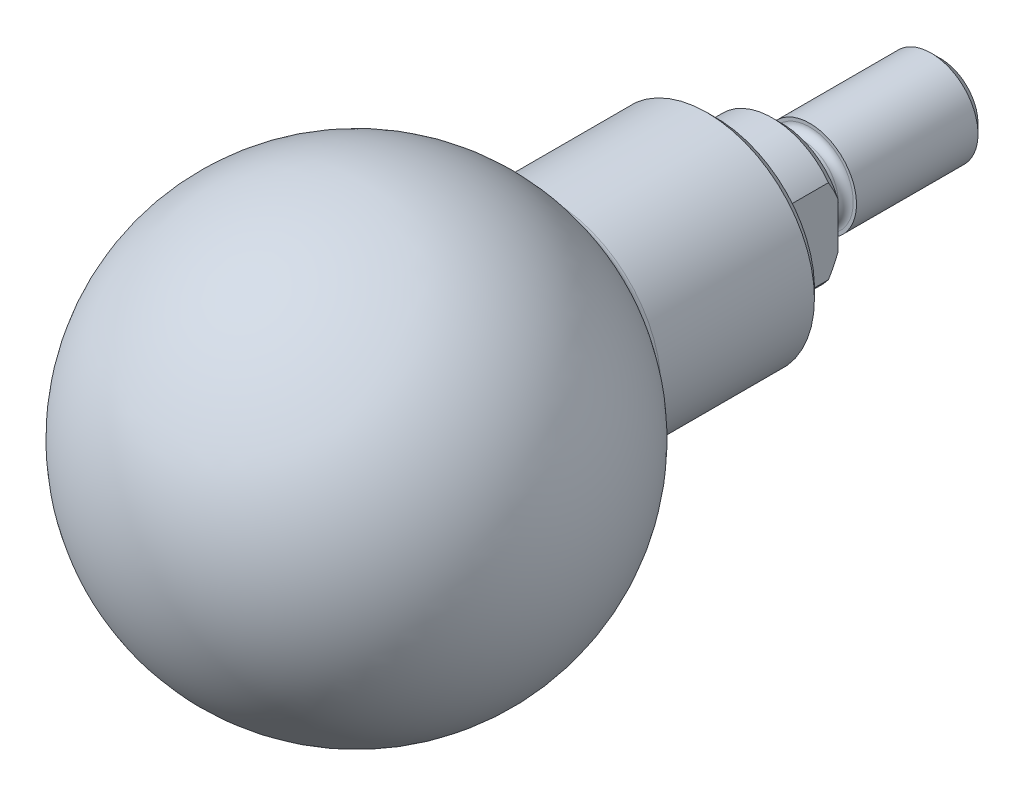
ISO-10303-21;
HEADER;
FILE_DESCRIPTION(('STEP AP214'),'2;1');
FILE_NAME('part.step','',(''),(''),'','','');
FILE_SCHEMA(('AUTOMOTIVE_DESIGN { 1 0 10303 214 1 1 1 1 }'));
ENDSEC;
DATA;
#1=APPLICATION_CONTEXT('core data for automotive mechanical design processes');
#2=APPLICATION_PROTOCOL_DEFINITION('international standard','automotive_design',2000,#1);
#3=PRODUCT_CONTEXT('',#1,'mechanical');
#4=PRODUCT('Part','Part','',(#3));
#5=PRODUCT_RELATED_PRODUCT_CATEGORY('part','',(#4));
#6=PRODUCT_DEFINITION_FORMATION('','',#4);
#7=PRODUCT_DEFINITION_CONTEXT('part definition',#1,'design');
#8=PRODUCT_DEFINITION('design','',#6,#7);
#9=PRODUCT_DEFINITION_SHAPE('','',#8);
#10=(LENGTH_UNIT() NAMED_UNIT(*) SI_UNIT(.MILLI.,.METRE.));
#11=(NAMED_UNIT(*) PLANE_ANGLE_UNIT() SI_UNIT($,.RADIAN.));
#12=(NAMED_UNIT(*) SI_UNIT($,.STERADIAN.) SOLID_ANGLE_UNIT());
#13=UNCERTAINTY_MEASURE_WITH_UNIT(LENGTH_MEASURE(1.E-05),#10,'distance_accuracy_value','');
#14=(GEOMETRIC_REPRESENTATION_CONTEXT(3) GLOBAL_UNCERTAINTY_ASSIGNED_CONTEXT((#13)) GLOBAL_UNIT_ASSIGNED_CONTEXT((#10,
#11,#12)) REPRESENTATION_CONTEXT('',''));
#15=CARTESIAN_POINT('',(0.,0.,0.));
#16=DIRECTION('',(0.,0.,1.));
#17=DIRECTION('',(1.,0.,0.));
#18=AXIS2_PLACEMENT_3D('',#15,#16,#17);
#19=CARTESIAN_POINT('',(-5.,0.,0.));
#20=DIRECTION('',(0.,0.,-1.));
#21=DIRECTION('',(0.,-1.,0.));
#22=AXIS2_PLACEMENT_3D('',#19,#20,#21);
#23=PLANE('',#22);
#24=CARTESIAN_POINT('',(0.,0.,0.));
#25=DIRECTION('',(0.,0.,-1.));
#26=DIRECTION('',(0.,-1.,0.));
#27=AXIS2_PLACEMENT_3D('',#24,#25,#26);
#28=CIRCLE('',#27,6.5);
#29=CARTESIAN_POINT('',(-6.,2.5,0.));
#30=VERTEX_POINT('',#29);
#31=CARTESIAN_POINT('',(6.,2.5,0.));
#32=VERTEX_POINT('',#31);
#33=EDGE_CURVE('E168',#30,#32,#28,.T.);
#34=ORIENTED_EDGE('',*,*,#33,.T.);
#35=DIRECTION('',(0.,-1.,0.));
#36=VECTOR('',#35,1.);
#37=CARTESIAN_POINT('',(6.,0.,0.));
#38=LINE('',#37,#36);
#39=CARTESIAN_POINT('',(6.,-2.5,0.));
#40=VERTEX_POINT('',#39);
#41=EDGE_CURVE('E30',#32,#40,#38,.T.);
#42=ORIENTED_EDGE('',*,*,#41,.T.);
#43=CARTESIAN_POINT('',(-6.,-2.5,0.));
#44=VERTEX_POINT('',#43);
#45=EDGE_CURVE('E192',#40,#44,#28,.T.);
#46=ORIENTED_EDGE('',*,*,#45,.T.);
#47=DIRECTION('',(0.,-1.,0.));
#48=VECTOR('',#47,1.);
#49=CARTESIAN_POINT('',(-6.,0.,0.));
#50=LINE('',#49,#48);
#51=EDGE_CURVE('E187',#30,#44,#50,.T.);
#52=ORIENTED_EDGE('',*,*,#51,.F.);
#53=EDGE_LOOP('',(#34,#42,#46,#52));
#54=FACE_BOUND('',#53,.T.);
#55=CARTESIAN_POINT('',(0.,0.,0.));
#56=DIRECTION('',(0.,0.,1.));
#57=DIRECTION('',(1.,0.,0.));
#58=AXIS2_PLACEMENT_3D('',#55,#56,#57);
#59=CIRCLE('',#58,4.65);
#60=CARTESIAN_POINT('',(4.65,0.,0.));
#61=VERTEX_POINT('',#60);
#62=EDGE_CURVE('E171',#61,#61,#59,.T.);
#63=ORIENTED_EDGE('',*,*,#62,.T.);
#64=EDGE_LOOP('',(#63));
#65=FACE_BOUND('',#64,.T.);
#66=ADVANCED_FACE('F14',(#54,#65),#23,.T.);
#67=CARTESIAN_POINT('',(0.,0.,-22.));
#68=DIRECTION('',(0.,0.,-1.));
#69=DIRECTION('',(0.,-1.,0.));
#70=AXIS2_PLACEMENT_3D('',#67,#68,#69);
#71=CYLINDRICAL_SURFACE('',#70,7.5);
#72=DIRECTION('',(0.,0.,-1.));
#73=VECTOR('',#72,1.);
#74=CARTESIAN_POINT('',(6.,-4.5,-22.));
#75=LINE('',#74,#73);
#76=CARTESIAN_POINT('',(6.,-4.5,7.));
#77=VERTEX_POINT('',#76);
#78=CARTESIAN_POINT('',(6.,-4.5,1.));
#79=VERTEX_POINT('',#78);
#80=EDGE_CURVE('E182',#77,#79,#75,.T.);
#81=ORIENTED_EDGE('',*,*,#80,.F.);
#82=CARTESIAN_POINT('',(0.,0.,7.));
#83=DIRECTION('',(0.,0.,-1.));
#84=DIRECTION('',(0.,-1.,0.));
#85=AXIS2_PLACEMENT_3D('',#82,#83,#84);
#86=CIRCLE('',#85,7.5);
#87=CARTESIAN_POINT('',(-6.,-4.5,7.));
#88=VERTEX_POINT('',#87);
#89=EDGE_CURVE('E84',#77,#88,#86,.T.);
#90=ORIENTED_EDGE('',*,*,#89,.T.);
#91=DIRECTION('',(0.,0.,-1.));
#92=VECTOR('',#91,1.);
#93=CARTESIAN_POINT('',(-6.,-4.5,-22.));
#94=LINE('',#93,#92);
#95=CARTESIAN_POINT('',(-6.,-4.5,1.));
#96=VERTEX_POINT('',#95);
#97=EDGE_CURVE('E190',#88,#96,#94,.T.);
#98=ORIENTED_EDGE('',*,*,#97,.T.);
#99=CARTESIAN_POINT('',(0.,0.,1.));
#100=DIRECTION('',(0.,0.,-1.));
#101=DIRECTION('',(0.,-1.,0.));
#102=AXIS2_PLACEMENT_3D('',#99,#100,#101);
#103=CIRCLE('',#102,7.5);
#104=EDGE_CURVE('E193',#79,#96,#103,.T.);
#105=ORIENTED_EDGE('',*,*,#104,.F.);
#106=EDGE_LOOP('',(#81,#90,#98,#105));
#107=FACE_BOUND('',#106,.T.);
#108=ADVANCED_FACE('F127',(#107),#71,.T.);
#109=DIRECTION('',(0.,0.,-1.));
#110=VECTOR('',#109,1.);
#111=CARTESIAN_POINT('',(6.,4.5,-22.));
#112=LINE('',#111,#110);
#113=CARTESIAN_POINT('',(6.,4.5,1.));
#114=VERTEX_POINT('',#113);
#115=CARTESIAN_POINT('',(6.,4.5,7.));
#116=VERTEX_POINT('',#115);
#117=EDGE_CURVE('E66',#114,#116,#112,.F.);
#118=ORIENTED_EDGE('',*,*,#117,.F.);
#119=CARTESIAN_POINT('',(-6.,4.5,1.));
#120=VERTEX_POINT('',#119);
#121=EDGE_CURVE('E92',#120,#114,#103,.T.);
#122=ORIENTED_EDGE('',*,*,#121,.F.);
#123=DIRECTION('',(0.,0.,-1.));
#124=VECTOR('',#123,1.);
#125=CARTESIAN_POINT('',(-6.,4.5,-22.));
#126=LINE('',#125,#124);
#127=CARTESIAN_POINT('',(-6.,4.5,7.));
#128=VERTEX_POINT('',#127);
#129=EDGE_CURVE('E38',#120,#128,#126,.F.);
#130=ORIENTED_EDGE('',*,*,#129,.T.);
#131=EDGE_CURVE('E83',#128,#116,#86,.T.);
#132=ORIENTED_EDGE('',*,*,#131,.T.);
#133=EDGE_LOOP('',(#118,#122,#130,#132));
#134=FACE_BOUND('',#133,.T.);
#135=ADVANCED_FACE('F86',(#134),#71,.T.);
#136=CARTESIAN_POINT('',(0.,0.,1.));
#137=DIRECTION('',(0.,0.,1.));
#138=DIRECTION('',(0.,1.,0.));
#139=AXIS2_PLACEMENT_3D('',#136,#137,#138);
#140=CONICAL_SURFACE('',#139,7.5,0.785398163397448);
#141=CARTESIAN_POINT('',(6.,10.3130926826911,5.43146599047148));
#142=CARTESIAN_POINT('',(6.,10.0655205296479,5.21751654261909));
#143=CARTESIAN_POINT('',(6.,9.81701833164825,5.00463051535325));
#144=CARTESIAN_POINT('',(6.,9.31765871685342,4.58155698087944));
#145=CARTESIAN_POINT('',(6.,9.06680091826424,4.37136992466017));
#146=CARTESIAN_POINT('',(6.,8.56053930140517,3.95286799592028));
#147=CARTESIAN_POINT('',(6.,8.30511590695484,3.74457674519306));
#148=CARTESIAN_POINT('',(6.,7.79085536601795,3.33228285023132));
#149=CARTESIAN_POINT('',(6.,7.53201847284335,3.12827989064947));
#150=CARTESIAN_POINT('',(6.,6.98862232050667,2.709151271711));
#151=CARTESIAN_POINT('',(6.,6.70370040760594,2.49449347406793));
#152=CARTESIAN_POINT('',(6.,6.1275241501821,2.07366874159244));
#153=CARTESIAN_POINT('',(6.,5.83626830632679,1.86750385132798));
#154=CARTESIAN_POINT('',(6.,5.24662347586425,1.46744306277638));
#155=CARTESIAN_POINT('',(6.,4.94825856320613,1.27351214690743));
#156=CARTESIAN_POINT('',(6.,4.49322817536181,0.994986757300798));
#157=CARTESIAN_POINT('',(6.,4.34033653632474,0.904224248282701));
#158=CARTESIAN_POINT('',(6.,4.03173263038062,0.727643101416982));
#159=CARTESIAN_POINT('',(6.,3.87602072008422,0.641823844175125));
#160=CARTESIAN_POINT('',(6.,3.61310554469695,0.503319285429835));
#161=CARTESIAN_POINT('',(6.,3.50676029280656,0.449006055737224));
#162=CARTESIAN_POINT('',(6.,3.29257477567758,0.343417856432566));
#163=CARTESIAN_POINT('',(6.,3.1847345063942,0.292142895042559));
#164=CARTESIAN_POINT('',(6.,2.85878731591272,0.143435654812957));
#165=CARTESIAN_POINT('',(6.,2.63828519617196,0.0511377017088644));
#166=CARTESIAN_POINT('',(6.,2.19371379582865,-0.114824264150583));
#167=CARTESIAN_POINT('',(6.,1.96973381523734,-0.188724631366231));
#168=CARTESIAN_POINT('',(6.,1.51582747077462,-0.31531052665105));
#169=CARTESIAN_POINT('',(6.,1.28590425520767,-0.368007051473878));
#170=CARTESIAN_POINT('',(6.,0.876430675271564,-0.438846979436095));
#171=CARTESIAN_POINT('',(6.,0.697782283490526,-0.462207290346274));
#172=CARTESIAN_POINT('',(6.,0.339125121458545,-0.493076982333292));
#173=CARTESIAN_POINT('',(6.,0.159116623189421,-0.500589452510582));
#174=CARTESIAN_POINT('',(6.,-0.200861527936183,-0.499337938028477));
#175=CARTESIAN_POINT('',(6.,-0.380831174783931,-0.490572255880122));
#176=CARTESIAN_POINT('',(6.,-0.739309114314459,-0.457261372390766));
#177=CARTESIAN_POINT('',(6.,-0.917817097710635,-0.432712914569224));
#178=CARTESIAN_POINT('',(6.,-1.32540328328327,-0.359530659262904));
#179=CARTESIAN_POINT('',(6.,-1.55358031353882,-0.305879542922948));
#180=CARTESIAN_POINT('',(6.,-2.00401392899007,-0.177871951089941));
#181=CARTESIAN_POINT('',(6.,-2.2262676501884,-0.103505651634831));
#182=CARTESIAN_POINT('',(6.,-2.66755500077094,0.0630384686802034));
#183=CARTESIAN_POINT('',(6.,-2.88649724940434,0.15545559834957));
#184=CARTESIAN_POINT('',(6.,-3.21017428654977,0.304120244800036));
#185=CARTESIAN_POINT('',(6.,-3.31726762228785,0.355343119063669));
#186=CARTESIAN_POINT('',(6.,-3.52997860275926,0.460762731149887));
#187=CARTESIAN_POINT('',(6.,-3.63559629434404,0.514959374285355));
#188=CARTESIAN_POINT('',(6.,-3.94622481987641,0.679287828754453));
#189=CARTESIAN_POINT('',(6.,-4.14926653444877,0.793146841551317));
#190=CARTESIAN_POINT('',(6.,-4.55072026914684,1.02878860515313));
#191=CARTESIAN_POINT('',(6.,-4.74913115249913,1.15057327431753));
#192=CARTESIAN_POINT('',(6.,-5.14212327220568,1.40053324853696));
#193=CARTESIAN_POINT('',(6.,-5.33670087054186,1.52871425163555));
#194=CARTESIAN_POINT('',(6.,-5.72241014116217,1.79010728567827));
#195=CARTESIAN_POINT('',(6.,-5.91354208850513,1.92331891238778));
#196=CARTESIAN_POINT('',(6.,-6.29374822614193,2.19444777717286));
#197=CARTESIAN_POINT('',(6.,-6.48280904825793,2.33238371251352));
#198=CARTESIAN_POINT('',(6.,-6.85841344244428,2.61164642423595));
#199=CARTESIAN_POINT('',(6.,-7.04495692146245,2.75297332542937));
#200=CARTESIAN_POINT('',(6.,-7.60117657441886,3.18099010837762));
#201=CARTESIAN_POINT('',(6.,-7.96763796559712,3.47185772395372));
#202=CARTESIAN_POINT('',(6.,-8.6568955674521,4.03118084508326));
#203=CARTESIAN_POINT('',(6.,-8.98031469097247,4.29887455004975));
#204=CARTESIAN_POINT('',(6.,-9.62316368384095,4.83908849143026));
#205=CARTESIAN_POINT('',(6.,-9.94259303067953,5.11160934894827));
#206=CARTESIAN_POINT('',(6.,-10.5751403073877,5.65764347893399));
#207=CARTESIAN_POINT('',(6.,-10.8882894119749,5.93112073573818));
#208=CARTESIAN_POINT('',(6.,-11.5119693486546,6.48091563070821));
#209=CARTESIAN_POINT('',(6.,-11.8225007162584,6.75723266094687));
#210=CARTESIAN_POINT('',(6.,-12.1320438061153,7.03464025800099));
#211=B_SPLINE_CURVE_WITH_KNOTS('',3,(#141,#142,#143,#144,#145,#146,#147,#148,#149,#150,#151,
#152,#153,#154,#155,#156,#157,#158,#159,#160,#161,#162,#163,#164,#165,#166,#167,#168,#169,#170,
#171,#172,#173,#174,#175,#176,#177,#178,#179,#180,#181,#182,#183,#184,#185,#186,#187,#188,#189,
#190,#191,#192,#193,#194,#195,#196,#197,#198,#199,#200,#201,#202,#203,#204,#205,#206,#207,#208,
#209,#210),.UNSPECIFIED.,.F.,.F.,(4,2,2,2,2,2,2,2,2,2,2,2,2,2,2,2,2,2,2,2,2,2,2,2,2,2,2,2,2,2,2,
2,2,2,4),(0.,0.981639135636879,1.9634402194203,2.95215814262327,3.94080310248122,
5.01087904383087,6.08121110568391,7.14832575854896,7.68166298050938,8.21493322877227,
8.57312457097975,8.93131688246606,9.64780743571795,10.3545535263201,11.0609326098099,
11.6007988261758,12.1405598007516,12.6803770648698,13.2203057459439,13.9222752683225,
14.6245782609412,15.3369157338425,15.6930190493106,16.0491110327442,16.7472209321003,
17.4455004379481,18.1444135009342,18.8432705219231,19.5453162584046,20.2473878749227,
21.6508059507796,22.910256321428,24.1698699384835,25.4171160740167,26.6641005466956),.UNSPECIFIED.);
#212=EDGE_CURVE('E200',#79,#40,#211,.F.);
#213=ORIENTED_EDGE('',*,*,#212,.F.);
#214=ORIENTED_EDGE('',*,*,#104,.T.);
#215=CARTESIAN_POINT('',(-6.,10.3130926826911,5.43146599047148));
#216=CARTESIAN_POINT('',(-6.,10.0655205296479,5.21751654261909));
#217=CARTESIAN_POINT('',(-6.,9.81701833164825,5.00463051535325));
#218=CARTESIAN_POINT('',(-6.,9.31765871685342,4.58155698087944));
#219=CARTESIAN_POINT('',(-6.,9.06680091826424,4.37136992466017));
#220=CARTESIAN_POINT('',(-6.,8.56053930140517,3.95286799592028));
#221=CARTESIAN_POINT('',(-6.,8.30511590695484,3.74457674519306));
#222=CARTESIAN_POINT('',(-6.,7.79085536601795,3.33228285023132));
#223=CARTESIAN_POINT('',(-6.,7.53201847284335,3.12827989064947));
#224=CARTESIAN_POINT('',(-6.,6.98862232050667,2.709151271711));
#225=CARTESIAN_POINT('',(-6.,6.70370040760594,2.49449347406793));
#226=CARTESIAN_POINT('',(-6.,6.1275241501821,2.07366874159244));
#227=CARTESIAN_POINT('',(-6.,5.83626830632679,1.86750385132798));
#228=CARTESIAN_POINT('',(-6.,5.24662347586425,1.46744306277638));
#229=CARTESIAN_POINT('',(-6.,4.94825856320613,1.27351214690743));
#230=CARTESIAN_POINT('',(-6.,4.49322817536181,0.994986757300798));
#231=CARTESIAN_POINT('',(-6.,4.34033653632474,0.904224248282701));
#232=CARTESIAN_POINT('',(-6.,4.03173263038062,0.727643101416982));
#233=CARTESIAN_POINT('',(-6.,3.87602072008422,0.641823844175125));
#234=CARTESIAN_POINT('',(-6.,3.61310554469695,0.503319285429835));
#235=CARTESIAN_POINT('',(-6.,3.50676029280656,0.449006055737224));
#236=CARTESIAN_POINT('',(-6.,3.29257477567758,0.343417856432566));
#237=CARTESIAN_POINT('',(-6.,3.1847345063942,0.292142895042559));
#238=CARTESIAN_POINT('',(-6.,2.85878731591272,0.143435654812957));
#239=CARTESIAN_POINT('',(-6.,2.63828519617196,0.0511377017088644));
#240=CARTESIAN_POINT('',(-6.,2.19371379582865,-0.114824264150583));
#241=CARTESIAN_POINT('',(-6.,1.96973381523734,-0.188724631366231));
#242=CARTESIAN_POINT('',(-6.,1.51582747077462,-0.31531052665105));
#243=CARTESIAN_POINT('',(-6.,1.28590425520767,-0.368007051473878));
#244=CARTESIAN_POINT('',(-6.,0.876430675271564,-0.438846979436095));
#245=CARTESIAN_POINT('',(-6.,0.697782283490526,-0.462207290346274));
#246=CARTESIAN_POINT('',(-6.,0.339125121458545,-0.493076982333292));
#247=CARTESIAN_POINT('',(-6.,0.159116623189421,-0.500589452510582));
#248=CARTESIAN_POINT('',(-6.,-0.200861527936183,-0.499337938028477));
#249=CARTESIAN_POINT('',(-6.,-0.380831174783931,-0.490572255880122));
#250=CARTESIAN_POINT('',(-6.,-0.739309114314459,-0.457261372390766));
#251=CARTESIAN_POINT('',(-6.,-0.917817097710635,-0.432712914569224));
#252=CARTESIAN_POINT('',(-6.,-1.32540328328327,-0.359530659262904));
#253=CARTESIAN_POINT('',(-6.,-1.55358031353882,-0.305879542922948));
#254=CARTESIAN_POINT('',(-6.,-2.00401392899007,-0.177871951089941));
#255=CARTESIAN_POINT('',(-6.,-2.2262676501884,-0.103505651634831));
#256=CARTESIAN_POINT('',(-6.,-2.66755500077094,0.0630384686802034));
#257=CARTESIAN_POINT('',(-6.,-2.88649724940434,0.15545559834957));
#258=CARTESIAN_POINT('',(-6.,-3.21017428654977,0.304120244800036));
#259=CARTESIAN_POINT('',(-6.,-3.31726762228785,0.355343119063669));
#260=CARTESIAN_POINT('',(-6.,-3.52997860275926,0.460762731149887));
#261=CARTESIAN_POINT('',(-6.,-3.63559629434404,0.514959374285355));
#262=CARTESIAN_POINT('',(-6.,-3.94622481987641,0.679287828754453));
#263=CARTESIAN_POINT('',(-6.,-4.14926653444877,0.793146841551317));
#264=CARTESIAN_POINT('',(-6.,-4.55072026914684,1.02878860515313));
#265=CARTESIAN_POINT('',(-6.,-4.74913115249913,1.15057327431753));
#266=CARTESIAN_POINT('',(-6.,-5.14212327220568,1.40053324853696));
#267=CARTESIAN_POINT('',(-6.,-5.33670087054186,1.52871425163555));
#268=CARTESIAN_POINT('',(-6.,-5.72241014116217,1.79010728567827));
#269=CARTESIAN_POINT('',(-6.,-5.91354208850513,1.92331891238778));
#270=CARTESIAN_POINT('',(-6.,-6.29374822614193,2.19444777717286));
#271=CARTESIAN_POINT('',(-6.,-6.48280904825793,2.33238371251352));
#272=CARTESIAN_POINT('',(-6.,-6.85841344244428,2.61164642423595));
#273=CARTESIAN_POINT('',(-6.,-7.04495692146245,2.75297332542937));
#274=CARTESIAN_POINT('',(-6.,-7.60117657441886,3.18099010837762));
#275=CARTESIAN_POINT('',(-6.,-7.96763796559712,3.47185772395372));
#276=CARTESIAN_POINT('',(-6.,-8.6568955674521,4.03118084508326));
#277=CARTESIAN_POINT('',(-6.,-8.98031469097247,4.29887455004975));
#278=CARTESIAN_POINT('',(-6.,-9.62316368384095,4.83908849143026));
#279=CARTESIAN_POINT('',(-6.,-9.94259303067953,5.11160934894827));
#280=CARTESIAN_POINT('',(-6.,-10.5751403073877,5.65764347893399));
#281=CARTESIAN_POINT('',(-6.,-10.8882894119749,5.93112073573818));
#282=CARTESIAN_POINT('',(-6.,-11.5119693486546,6.48091563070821));
#283=CARTESIAN_POINT('',(-6.,-11.8225007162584,6.75723266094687));
#284=CARTESIAN_POINT('',(-6.,-12.1320438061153,7.03464025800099));
#285=B_SPLINE_CURVE_WITH_KNOTS('',3,(#215,#216,#217,#218,#219,#220,#221,#222,#223,#224,#225,
#226,#227,#228,#229,#230,#231,#232,#233,#234,#235,#236,#237,#238,#239,#240,#241,#242,#243,#244,
#245,#246,#247,#248,#249,#250,#251,#252,#253,#254,#255,#256,#257,#258,#259,#260,#261,#262,#263,
#264,#265,#266,#267,#268,#269,#270,#271,#272,#273,#274,#275,#276,#277,#278,#279,#280,#281,#282,
#283,#284),.UNSPECIFIED.,.F.,.F.,(4,2,2,2,2,2,2,2,2,2,2,2,2,2,2,2,2,2,2,2,2,2,2,2,2,2,2,2,2,2,2,
2,2,2,4),(0.,0.981639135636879,1.9634402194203,2.95215814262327,3.94080310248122,
5.01087904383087,6.08121110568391,7.14832575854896,7.68166298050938,8.21493322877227,
8.57312457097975,8.93131688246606,9.64780743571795,10.3545535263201,11.0609326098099,
11.6007988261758,12.1405598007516,12.6803770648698,13.2203057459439,13.9222752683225,
14.6245782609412,15.3369157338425,15.6930190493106,16.0491110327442,16.7472209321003,
17.4455004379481,18.1444135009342,18.8432705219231,19.5453162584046,20.2473878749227,
21.6508059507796,22.910256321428,24.1698699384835,25.4171160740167,26.6641005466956),.UNSPECIFIED.);
#286=EDGE_CURVE('E112',#96,#44,#285,.F.);
#287=ORIENTED_EDGE('',*,*,#286,.T.);
#288=ORIENTED_EDGE('',*,*,#45,.F.);
#289=EDGE_LOOP('',(#213,#214,#287,#288));
#290=FACE_BOUND('',#289,.T.);
#291=ADVANCED_FACE('F121',(#290),#140,.T.);
#292=EDGE_CURVE('E71',#32,#114,#211,.F.);
#293=ORIENTED_EDGE('',*,*,#292,.F.);
#294=ORIENTED_EDGE('',*,*,#33,.F.);
#295=EDGE_CURVE('E104',#30,#120,#285,.F.);
#296=ORIENTED_EDGE('',*,*,#295,.T.);
#297=ORIENTED_EDGE('',*,*,#121,.T.);
#298=EDGE_LOOP('',(#293,#294,#296,#297));
#299=FACE_BOUND('',#298,.T.);
#300=ADVANCED_FACE('F125',(#299),#140,.T.);
#301=CARTESIAN_POINT('',(0.,0.,45.5));
#302=DIRECTION('',(0.,-1.,0.));
#303=DIRECTION('',(0.,0.,1.));
#304=AXIS2_PLACEMENT_3D('',#301,#302,#303);
#305=SPHERICAL_SURFACE('',#304,23.5);
#306=CARTESIAN_POINT('',(0.,0.,45.5));
#307=DIRECTION('',(0.,0.,-1.));
#308=DIRECTION('',(0.,-1.,0.));
#309=AXIS2_PLACEMENT_3D('',#306,#307,#308);
#310=SPHERICAL_SURFACE('',#309,23.5);
#311=CARTESIAN_POINT('',(0.,0.,25.2887458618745));
#312=DIRECTION('',(0.,0.,-1.));
#313=DIRECTION('',(0.,-1.,0.));
#314=AXIS2_PLACEMENT_3D('',#311,#312,#313);
#315=CIRCLE('',#314,11.9897959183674);
#316=CARTESIAN_POINT('',(0.,-11.9897959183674,25.2887458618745));
#317=VERTEX_POINT('',#316);
#318=EDGE_CURVE('E101',#317,#317,#315,.T.);
#319=ORIENTED_EDGE('',*,*,#318,.F.);
#320=EDGE_LOOP('',(#319));
#321=FACE_BOUND('',#320,.T.);
#322=ADVANCED_FACE('F145',(#321),#310,.T.);
#323=CARTESIAN_POINT('',(0.,0.,24.4286924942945));
#324=DIRECTION('',(0.,0.,-1.));
#325=DIRECTION('',(0.,-1.,0.));
#326=AXIS2_PLACEMENT_3D('',#323,#324,#325);
#327=TOROIDAL_SURFACE('',#326,12.5,1.);
#328=ORIENTED_EDGE('',*,*,#318,.T.);
#329=EDGE_LOOP('',(#328));
#330=FACE_BOUND('',#329,.T.);
#331=CARTESIAN_POINT('',(0.,0.,24.4286924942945));
#332=DIRECTION('',(0.,0.,-1.));
#333=DIRECTION('',(0.,-1.,0.));
#334=AXIS2_PLACEMENT_3D('',#331,#332,#333);
#335=CIRCLE('',#334,11.5);
#336=CARTESIAN_POINT('',(0.,-11.5,24.4286924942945));
#337=VERTEX_POINT('',#336);
#338=EDGE_CURVE('E98',#337,#337,#335,.T.);
#339=ORIENTED_EDGE('',*,*,#338,.F.);
#340=EDGE_LOOP('',(#339));
#341=FACE_BOUND('',#340,.T.);
#342=ADVANCED_FACE('F141',(#330,#341),#327,.F.);
#343=CARTESIAN_POINT('',(0.,0.,-22.));
#344=DIRECTION('',(0.,0.,-1.));
#345=DIRECTION('',(0.,-1.,0.));
#346=AXIS2_PLACEMENT_3D('',#343,#344,#345);
#347=CYLINDRICAL_SURFACE('',#346,11.5);
#348=ORIENTED_EDGE('',*,*,#338,.T.);
#349=EDGE_LOOP('',(#348));
#350=FACE_BOUND('',#349,.T.);
#351=CARTESIAN_POINT('',(0.,0.,8.));
#352=DIRECTION('',(0.,0.,-1.));
#353=DIRECTION('',(0.,-1.,0.));
#354=AXIS2_PLACEMENT_3D('',#351,#352,#353);
#355=CIRCLE('',#354,11.5);
#356=CARTESIAN_POINT('',(0.,-11.5,8.));
#357=VERTEX_POINT('',#356);
#358=EDGE_CURVE('E90',#357,#357,#355,.T.);
#359=ORIENTED_EDGE('',*,*,#358,.F.);
#360=EDGE_LOOP('',(#359));
#361=FACE_BOUND('',#360,.T.);
#362=ADVANCED_FACE('F137',(#350,#361),#347,.T.);
#363=CARTESIAN_POINT('',(0.,0.,8.));
#364=DIRECTION('',(0.,0.,1.));
#365=DIRECTION('',(0.,1.,0.));
#366=AXIS2_PLACEMENT_3D('',#363,#364,#365);
#367=CONICAL_SURFACE('',#366,11.5,0.785398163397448);
#368=CARTESIAN_POINT('',(0.,0.,7.));
#369=DIRECTION('',(0.,0.,-1.));
#370=DIRECTION('',(0.,-1.,0.));
#371=AXIS2_PLACEMENT_3D('',#368,#369,#370);
#372=CIRCLE('',#371,10.5);
#373=CARTESIAN_POINT('',(0.,-10.5,7.));
#374=VERTEX_POINT('',#373);
#375=EDGE_CURVE('E87',#374,#374,#372,.T.);
#376=ORIENTED_EDGE('',*,*,#375,.F.);
#377=EDGE_LOOP('',(#376));
#378=FACE_BOUND('',#377,.T.);
#379=ORIENTED_EDGE('',*,*,#358,.T.);
#380=EDGE_LOOP('',(#379));
#381=FACE_BOUND('',#380,.T.);
#382=ADVANCED_FACE('F134',(#378,#381),#367,.T.);
#383=CARTESIAN_POINT('',(-10.5,0.,7.));
#384=DIRECTION('',(0.,0.,1.));
#385=DIRECTION('',(0.,1.,0.));
#386=AXIS2_PLACEMENT_3D('',#383,#384,#385);
#387=PLANE('',#386);
#388=ORIENTED_EDGE('',*,*,#89,.F.);
#389=DIRECTION('',(0.,-1.,0.));
#390=VECTOR('',#389,1.);
#391=CARTESIAN_POINT('',(6.,5.,7.));
#392=LINE('',#391,#390);
#393=EDGE_CURVE('E69',#116,#77,#392,.T.);
#394=ORIENTED_EDGE('',*,*,#393,.F.);
#395=ORIENTED_EDGE('',*,*,#131,.F.);
#396=DIRECTION('',(0.,-1.,0.));
#397=VECTOR('',#396,1.);
#398=CARTESIAN_POINT('',(-6.,5.,7.));
#399=LINE('',#398,#397);
#400=EDGE_CURVE('E184',#128,#88,#399,.T.);
#401=ORIENTED_EDGE('',*,*,#400,.T.);
#402=EDGE_LOOP('',(#388,#394,#395,#401));
#403=FACE_BOUND('',#402,.T.);
#404=ORIENTED_EDGE('',*,*,#375,.T.);
#405=EDGE_LOOP('',(#404));
#406=FACE_BOUND('',#405,.T.);
#407=ADVANCED_FACE('F80',(#403,#406),#387,.F.);
#408=CARTESIAN_POINT('',(-6.,5.,-0.886589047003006));
#409=DIRECTION('',(1.,0.,0.));
#410=DIRECTION('',(0.,1.,0.));
#411=AXIS2_PLACEMENT_3D('',#408,#409,#410);
#412=PLANE('',#411);
#413=ORIENTED_EDGE('',*,*,#400,.F.);
#414=ORIENTED_EDGE('',*,*,#129,.F.);
#415=ORIENTED_EDGE('',*,*,#295,.F.);
#416=ORIENTED_EDGE('',*,*,#51,.T.);
#417=ORIENTED_EDGE('',*,*,#286,.F.);
#418=ORIENTED_EDGE('',*,*,#97,.F.);
#419=EDGE_LOOP('',(#413,#414,#415,#416,#417,#418));
#420=FACE_BOUND('',#419,.T.);
#421=ADVANCED_FACE('F119',(#420),#412,.F.);
#422=CARTESIAN_POINT('',(6.,5.,-0.886589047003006));
#423=DIRECTION('',(1.,0.,0.));
#424=DIRECTION('',(0.,1.,0.));
#425=AXIS2_PLACEMENT_3D('',#422,#423,#424);
#426=PLANE('',#425);
#427=ORIENTED_EDGE('',*,*,#80,.T.);
#428=ORIENTED_EDGE('',*,*,#212,.T.);
#429=ORIENTED_EDGE('',*,*,#41,.F.);
#430=ORIENTED_EDGE('',*,*,#292,.T.);
#431=ORIENTED_EDGE('',*,*,#117,.T.);
#432=ORIENTED_EDGE('',*,*,#393,.T.);
#433=EDGE_LOOP('',(#427,#428,#429,#430,#431,#432));
#434=FACE_BOUND('',#433,.T.);
#435=ADVANCED_FACE('F68',(#434),#426,.T.);
#436=CARTESIAN_POINT('',(0.,4.65,-3.));
#437=DIRECTION('',(0.,0.,1.));
#438=DIRECTION('',(1.,0.,0.));
#439=AXIS2_PLACEMENT_3D('',#436,#437,#438);
#440=PLANE('',#439);
#441=CARTESIAN_POINT('',(0.,0.,-3.));
#442=DIRECTION('',(0.,0.,1.));
#443=DIRECTION('',(1.,0.,0.));
#444=AXIS2_PLACEMENT_3D('',#441,#442,#443);
#445=CIRCLE('',#444,4.65);
#446=CARTESIAN_POINT('',(4.65,0.,-3.));
#447=VERTEX_POINT('',#446);
#448=EDGE_CURVE('E239',#447,#447,#445,.T.);
#449=ORIENTED_EDGE('',*,*,#448,.F.);
#450=EDGE_LOOP('',(#449));
#451=FACE_BOUND('',#450,.T.);
#452=CARTESIAN_POINT('',(0.,0.,-3.));
#453=DIRECTION('',(0.,0.,1.));
#454=DIRECTION('',(1.,0.,0.));
#455=AXIS2_PLACEMENT_3D('',#452,#453,#454);
#456=CIRCLE('',#455,5.);
#457=CARTESIAN_POINT('',(5.,0.,-3.));
#458=VERTEX_POINT('',#457);
#459=EDGE_CURVE('E18',#458,#458,#456,.T.);
#460=ORIENTED_EDGE('',*,*,#459,.T.);
#461=EDGE_LOOP('',(#460));
#462=FACE_BOUND('',#461,.T.);
#463=ADVANCED_FACE('F213',(#451,#462),#440,.T.);
#464=CARTESIAN_POINT('',(0.,0.,-0.8));
#465=DIRECTION('',(0.,0.,1.));
#466=DIRECTION('',(1.,0.,0.));
#467=AXIS2_PLACEMENT_3D('',#464,#465,#466);
#468=TOROIDAL_SURFACE('',#467,4.65,0.8);
#469=CARTESIAN_POINT('',(0.,0.,-0.8));
#470=DIRECTION('',(0.,0.,1.));
#471=DIRECTION('',(1.,0.,0.));
#472=AXIS2_PLACEMENT_3D('',#469,#470,#471);
#473=CIRCLE('',#472,3.85);
#474=CARTESIAN_POINT('',(3.85,0.,-0.8));
#475=VERTEX_POINT('',#474);
#476=EDGE_CURVE('E173',#475,#475,#473,.T.);
#477=ORIENTED_EDGE('',*,*,#476,.T.);
#478=EDGE_LOOP('',(#477));
#479=FACE_BOUND('',#478,.T.);
#480=ORIENTED_EDGE('',*,*,#62,.F.);
#481=EDGE_LOOP('',(#480));
#482=FACE_BOUND('',#481,.T.);
#483=ADVANCED_FACE('F215',(#479,#482),#468,.F.);
#484=CARTESIAN_POINT('',(0.,0.,18.671110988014));
#485=DIRECTION('',(0.,0.,1.));
#486=DIRECTION('',(1.,0.,0.));
#487=AXIS2_PLACEMENT_3D('',#484,#485,#486);
#488=CYLINDRICAL_SURFACE('',#487,3.85);
#489=CARTESIAN_POINT('',(0.,0.,-2.2));
#490=DIRECTION('',(0.,0.,1.));
#491=DIRECTION('',(1.,0.,0.));
#492=AXIS2_PLACEMENT_3D('',#489,#490,#491);
#493=CIRCLE('',#492,3.85);
#494=CARTESIAN_POINT('',(3.85,0.,-2.2));
#495=VERTEX_POINT('',#494);
#496=EDGE_CURVE('E177',#495,#495,#493,.T.);
#497=ORIENTED_EDGE('',*,*,#496,.T.);
#498=EDGE_LOOP('',(#497));
#499=FACE_BOUND('',#498,.T.);
#500=ORIENTED_EDGE('',*,*,#476,.F.);
#501=EDGE_LOOP('',(#500));
#502=FACE_BOUND('',#501,.T.);
#503=ADVANCED_FACE('F223',(#499,#502),#488,.T.);
#504=CARTESIAN_POINT('',(0.,0.,-2.2));
#505=DIRECTION('',(0.,0.,1.));
#506=DIRECTION('',(1.,0.,0.));
#507=AXIS2_PLACEMENT_3D('',#504,#505,#506);
#508=TOROIDAL_SURFACE('',#507,4.65,0.8);
#509=ORIENTED_EDGE('',*,*,#448,.T.);
#510=EDGE_LOOP('',(#509));
#511=FACE_BOUND('',#510,.T.);
#512=ORIENTED_EDGE('',*,*,#496,.F.);
#513=EDGE_LOOP('',(#512));
#514=FACE_BOUND('',#513,.T.);
#515=ADVANCED_FACE('F153',(#511,#514),#508,.F.);
#516=CARTESIAN_POINT('',(0.,0.,-17.));
#517=DIRECTION('',(0.,0.,-1.));
#518=DIRECTION('',(0.,-1.,0.));
#519=AXIS2_PLACEMENT_3D('',#516,#517,#518);
#520=PLANE('',#519);
#521=CARTESIAN_POINT('',(0.,0.,-17.));
#522=DIRECTION('',(0.,0.,-1.));
#523=DIRECTION('',(-1.,0.,0.));
#524=AXIS2_PLACEMENT_3D('',#521,#522,#523);
#525=CIRCLE('',#524,4.);
#526=CARTESIAN_POINT('',(-4.,0.,-17.));
#527=VERTEX_POINT('',#526);
#528=EDGE_CURVE('E23',#527,#527,#525,.T.);
#529=ORIENTED_EDGE('',*,*,#528,.T.);
#530=EDGE_LOOP('',(#529));
#531=FACE_BOUND('',#530,.T.);
#532=ADVANCED_FACE('F150',(#531),#520,.T.);
#533=CARTESIAN_POINT('',(0.,0.,-17.));
#534=DIRECTION('',(0.,0.,1.));
#535=DIRECTION('',(1.,0.,0.));
#536=AXIS2_PLACEMENT_3D('',#533,#534,#535);
#537=CONICAL_SURFACE('',#536,4.,0.785398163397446);
#538=CARTESIAN_POINT('',(0.,0.,-16.));
#539=DIRECTION('',(0.,0.,-1.));
#540=DIRECTION('',(-1.,0.,0.));
#541=AXIS2_PLACEMENT_3D('',#538,#539,#540);
#542=CIRCLE('',#541,5.);
#543=CARTESIAN_POINT('',(-5.,0.,-16.));
#544=VERTEX_POINT('',#543);
#545=EDGE_CURVE('E9',#544,#544,#542,.F.);
#546=ORIENTED_EDGE('',*,*,#545,.F.);
#547=EDGE_LOOP('',(#546));
#548=FACE_BOUND('',#547,.T.);
#549=ORIENTED_EDGE('',*,*,#528,.F.);
#550=EDGE_LOOP('',(#549));
#551=FACE_BOUND('',#550,.T.);
#552=ADVANCED_FACE('F16',(#548,#551),#537,.T.);
#553=CARTESIAN_POINT('',(0.,0.,-22.));
#554=DIRECTION('',(0.,0.,-1.));
#555=DIRECTION('',(0.,-1.,0.));
#556=AXIS2_PLACEMENT_3D('',#553,#554,#555);
#557=CYLINDRICAL_SURFACE('',#556,5.);
#558=ORIENTED_EDGE('',*,*,#545,.T.);
#559=EDGE_LOOP('',(#558));
#560=FACE_BOUND('',#559,.T.);
#561=ORIENTED_EDGE('',*,*,#459,.F.);
#562=EDGE_LOOP('',(#561));
#563=FACE_BOUND('',#562,.T.);
#564=ADVANCED_FACE('F155',(#560,#563),#557,.T.);
#565=CLOSED_SHELL('',(#66,#108,#135,#291,#300,#322,#342,#362,#382,#407,#421,#435,#463,#483,#503,
#515,#532,#552,#564));
#566=MANIFOLD_SOLID_BREP('B1',#565);
#567=ADVANCED_BREP_SHAPE_REPRESENTATION('',(#18,#566),#14);
#568=SHAPE_DEFINITION_REPRESENTATION(#9,#567);
ENDSEC;
END-ISO-10303-21;
